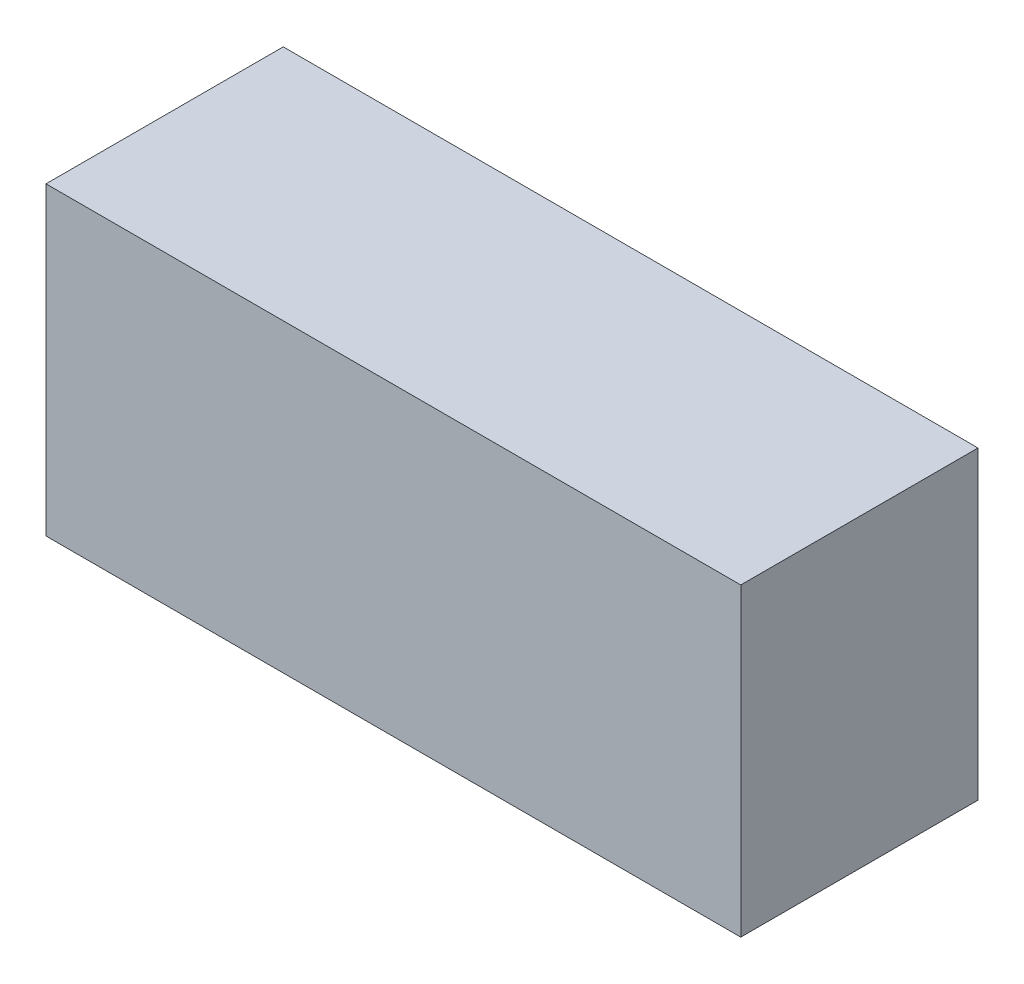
from build123d import *

# Parameters (mm, degrees)
ESQUISSE1_W      = 20.5
ESQUISSE1_H      = 9
EXTRUSION1_DEPTH = 7


with BuildPart() as part:
    # Esquisse1 → Extrusion1 (new body)
    with BuildSketch(Plane.XY):
        with Locations((10.25, 4.5)):
            Rectangle(ESQUISSE1_W, ESQUISSE1_H)
    extrude(amount=EXTRUSION1_DEPTH)


solid = part.part
